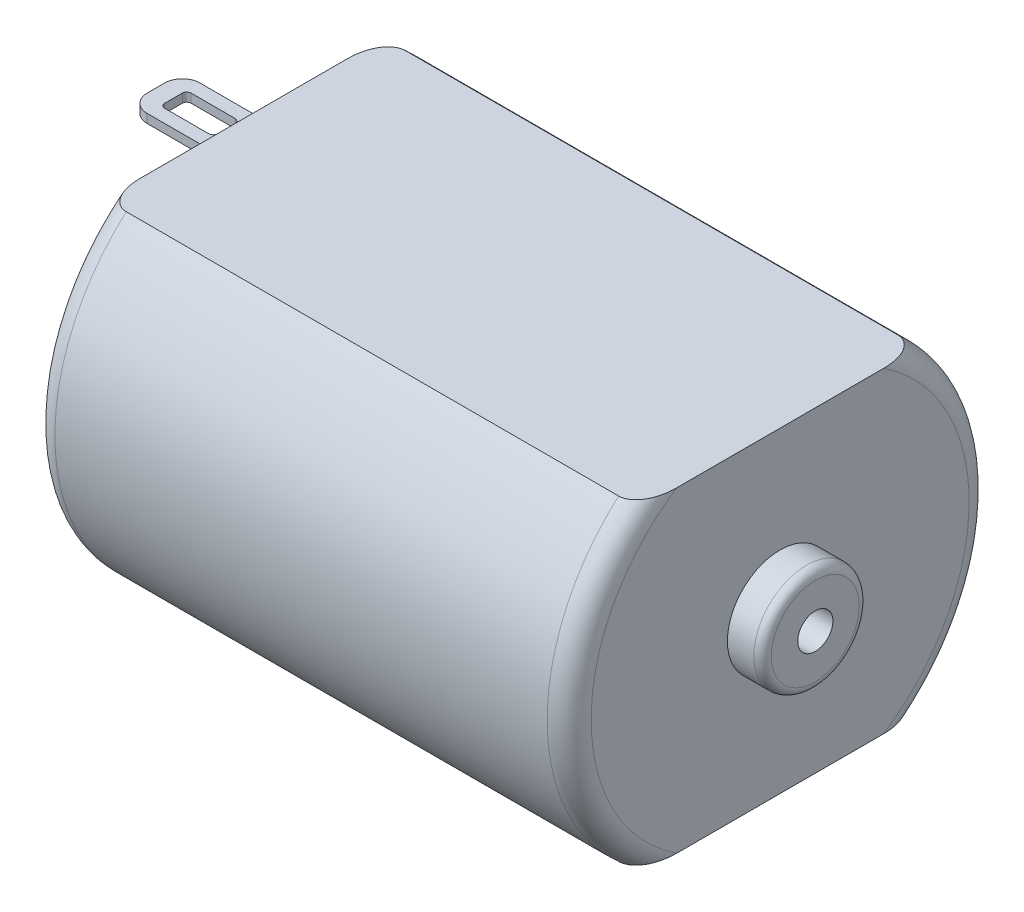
from build123d import *

# Parameters (mm, degrees)
ESQUISSE2_W                  = 3
ESQUISSE2_H                  = 0.5
EXTRUSION1_DEPTH             = 5
ENL_V_START                  = -0.5
ENL_V_MAT_EXTRU_1_DEPTH      = 0.5
R_P_TITION_CIRCULAIRE3_COUNT = 2
ESQUISSE4_W                  = 24
ESQUISSE4_H                  = 5
ENL_V_MAT_EXTRU_2_DEPTH      = 40.347808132
ESQUISSE5_R                  = 1
ENL_V_MAT_EXTRU_3_DEPTH      = 15


with BuildPart() as part:
    # Esquisse1 → R_volution1 (revolve)
    with BuildSketch(Plane.XY, mode=Mode.PRIVATE) as r_volution1_sk:
        with BuildLine():
            Line((-30.5, 10.75), (-30.5, 4))
            Line((-30.5, 4), (-32, 4))
            ThreePointArc((-32, 4), (-32.353553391, 3.853553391), (-32.5, 3.5))
            Line((-32.5, 3.5), (-32.5, 0))
            Line((-32.5, 0), (2, 0))
            Line((2, 0), (2, 2.5))
            ThreePointArc((2, 2.5), (1.853553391, 2.853553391), (1.5, 3))
            Line((1.5, 3), (0, 3))
            Line((0, 3), (0, 10.75))
            ThreePointArc((0, 10.75), (-0.366116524, 11.633883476), (-1.25, 12))
            Line((-1.25, 12), (-29.25, 12))
            ThreePointArc((-29.25, 12), (-30.133883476, 11.633883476), (-30.5, 10.75))
        make_face()
    revolve(r_volution1_sk.sketch.rotate(Axis((-35.724460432, 0, 0), (1, 0, 0)), 90), axis=Axis((-35.724460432, 0, 0), (1, 0, 0)))

    # Esquisse2 → Extrusion1 (add)
    with BuildSketch(Plane.ZY.offset(30.5)):
        with Locations((0, 7.75)):
            Rectangle(ESQUISSE2_W, ESQUISSE2_H)
    extrusion1 = extrude(amount=EXTRUSION1_DEPTH)

    # Esquisse3 → Enl_v. mat.-Extru.1 (cut)
    with BuildSketch(Plane(origin=(0, 8, 0), x_dir=(-1, 0, 0), z_dir=(0, 1, 0)).offset(ENL_V_START)):
        with BuildLine():
            Line((34.5, -1.5), (36, -1.5))
            Line((36, -1.5), (36, 1.5))
            Line((36, 1.5), (34.5, 1.5))
            ThreePointArc((34.5, 1.5), (35.207106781, 1.207106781), (35.5, 0.5))
            Line((35.5, 0.5), (35.5, -0.5))
            ThreePointArc((35.5, -0.5), (35.207106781, -1.207106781), (34.5, -1.5))
        make_face()
        with BuildLine():
            Line((34.25, -0.75), (31.75, -0.75))
            ThreePointArc((31.75, -0.75), (31.573223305, -0.676776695), (31.5, -0.5))
            Line((31.5, -0.5), (31.5, 0.5))
            ThreePointArc((31.5, 0.5), (31.573223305, 0.676776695), (31.75, 0.75))
            Line((31.75, 0.75), (34.25, 0.75))
            ThreePointArc((34.25, 0.75), (34.426776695, 0.676776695), (34.5, 0.5))
            Line((34.5, 0.5), (34.5, -0.5))
            ThreePointArc((34.5, -0.5), (34.426776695, -0.676776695), (34.25, -0.75))
        make_face()
    enl_v_mat_extru_1 = extrude(amount=ENL_V_MAT_EXTRU_1_DEPTH, mode=Mode.SUBTRACT)

    # R_p_tition circulaire3: Extrusion1, Enl_v. mat.-Extru.1 ×2 about axis
    r_p_tition_circulaire3_axis = Axis((0, 0, 0), (1, 0, 0))
    add([extrusion1.rotate(r_p_tition_circulaire3_axis, i * 360 / R_P_TITION_CIRCULAIRE3_COUNT) for i in range(1, R_P_TITION_CIRCULAIRE3_COUNT)])
    add([enl_v_mat_extru_1.rotate(r_p_tition_circulaire3_axis, i * 360 / R_P_TITION_CIRCULAIRE3_COUNT) for i in range(1, R_P_TITION_CIRCULAIRE3_COUNT)], mode=Mode.SUBTRACT)

    # Esquisse4 → Enl_v. mat.-Extru.2 (cut, through all)
    with BuildSketch(Plane(origin=(0, 0, 0), x_dir=(0, 0, -1), z_dir=(1, 0, 0))):
        with Locations((0, 11.5)):
            Rectangle(ESQUISSE4_W, ESQUISSE4_H)
    enl_v_mat_extru_2 = extrude(amount=-ENL_V_MAT_EXTRU_2_DEPTH, mode=Mode.SUBTRACT)

    # Sym_trie1: Enl_v. mat.-Extru.2 across plane
    add(enl_v_mat_extru_2.mirror(Plane.ZX), mode=Mode.SUBTRACT)

    # Esquisse5 → Enl_v. mat.-Extru.3 (cut)
    with BuildSketch(Plane(origin=(2, 0, 0), x_dir=(0, 0, -1), z_dir=(1, 0, 0))):
        Circle(ESQUISSE5_R)
    extrude(amount=-ENL_V_MAT_EXTRU_3_DEPTH, mode=Mode.SUBTRACT)


solid = part.part
